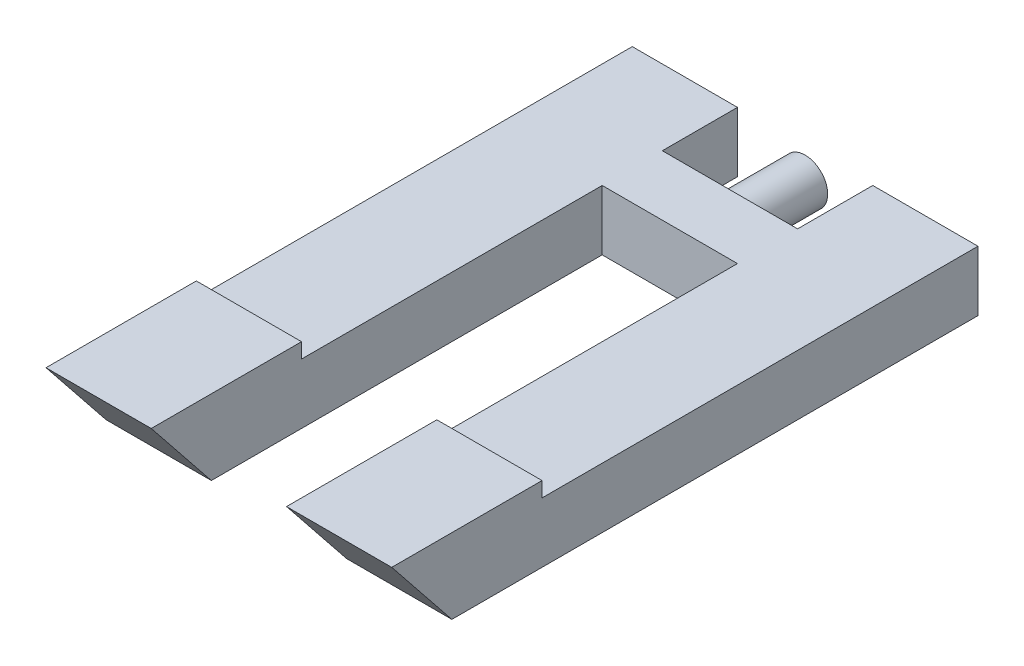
ISO-10303-21;
HEADER;
FILE_DESCRIPTION(('STEP AP214'),'2;1');
FILE_NAME('part.step','',(''),(''),'','','');
FILE_SCHEMA(('AUTOMOTIVE_DESIGN { 1 0 10303 214 1 1 1 1 }'));
ENDSEC;
DATA;
#1=APPLICATION_CONTEXT('core data for automotive mechanical design processes');
#2=APPLICATION_PROTOCOL_DEFINITION('international standard','automotive_design',2000,#1);
#3=PRODUCT_CONTEXT('',#1,'mechanical');
#4=PRODUCT('Part','Part','',(#3));
#5=PRODUCT_RELATED_PRODUCT_CATEGORY('part','',(#4));
#6=PRODUCT_DEFINITION_FORMATION('','',#4);
#7=PRODUCT_DEFINITION_CONTEXT('part definition',#1,'design');
#8=PRODUCT_DEFINITION('design','',#6,#7);
#9=PRODUCT_DEFINITION_SHAPE('','',#8);
#10=(LENGTH_UNIT() NAMED_UNIT(*) SI_UNIT(.MILLI.,.METRE.));
#11=(NAMED_UNIT(*) PLANE_ANGLE_UNIT() SI_UNIT($,.RADIAN.));
#12=(NAMED_UNIT(*) SI_UNIT($,.STERADIAN.) SOLID_ANGLE_UNIT());
#13=UNCERTAINTY_MEASURE_WITH_UNIT(LENGTH_MEASURE(1.E-05),#10,'distance_accuracy_value','');
#14=(GEOMETRIC_REPRESENTATION_CONTEXT(3) GLOBAL_UNCERTAINTY_ASSIGNED_CONTEXT((#13)) GLOBAL_UNIT_ASSIGNED_CONTEXT((#10,
#11,#12)) REPRESENTATION_CONTEXT('',''));
#15=CARTESIAN_POINT('',(0.,0.,0.));
#16=DIRECTION('',(0.,0.,1.));
#17=DIRECTION('',(1.,0.,0.));
#18=AXIS2_PLACEMENT_3D('',#15,#16,#17);
#19=CARTESIAN_POINT('',(-4.5,2.,4.));
#20=DIRECTION('',(0.,0.,-1.));
#21=DIRECTION('',(-1.,0.,0.));
#22=AXIS2_PLACEMENT_3D('',#19,#20,#21);
#23=PLANE('',#22);
#24=DIRECTION('',(1.,0.,0.));
#25=VECTOR('',#24,1.);
#26=CARTESIAN_POINT('',(-4.5,-2.,4.));
#27=LINE('',#26,#25);
#28=CARTESIAN_POINT('',(-4.5,-2.,4.));
#29=VERTEX_POINT('',#28);
#30=CARTESIAN_POINT('',(4.5,-2.,4.));
#31=VERTEX_POINT('',#30);
#32=EDGE_CURVE('E270',#29,#31,#27,.T.);
#33=ORIENTED_EDGE('',*,*,#32,.T.);
#34=DIRECTION('',(0.,-1.,0.));
#35=VECTOR('',#34,1.);
#36=CARTESIAN_POINT('',(4.5,2.,4.));
#37=LINE('',#36,#35);
#38=CARTESIAN_POINT('',(4.5,2.,4.));
#39=VERTEX_POINT('',#38);
#40=EDGE_CURVE('E209',#39,#31,#37,.T.);
#41=ORIENTED_EDGE('',*,*,#40,.F.);
#42=DIRECTION('',(1.,0.,0.));
#43=VECTOR('',#42,1.);
#44=CARTESIAN_POINT('',(-4.5,2.,4.));
#45=LINE('',#44,#43);
#46=CARTESIAN_POINT('',(-4.5,2.,4.));
#47=VERTEX_POINT('',#46);
#48=EDGE_CURVE('E271',#47,#39,#45,.T.);
#49=ORIENTED_EDGE('',*,*,#48,.F.);
#50=DIRECTION('',(0.,-1.,0.));
#51=VECTOR('',#50,1.);
#52=CARTESIAN_POINT('',(-4.5,2.,4.));
#53=LINE('',#52,#51);
#54=EDGE_CURVE('E289',#47,#29,#53,.T.);
#55=ORIENTED_EDGE('',*,*,#54,.T.);
#56=EDGE_LOOP('',(#33,#41,#49,#55));
#57=FACE_BOUND('',#56,.T.);
#58=ADVANCED_FACE('F39',(#57),#23,.F.);
#59=CARTESIAN_POINT('',(-4.5,2.,0.));
#60=DIRECTION('',(0.,0.,1.));
#61=DIRECTION('',(1.,0.,0.));
#62=AXIS2_PLACEMENT_3D('',#59,#60,#61);
#63=PLANE('',#62);
#64=CARTESIAN_POINT('',(0.,0.,0.));
#65=DIRECTION('',(0.,0.,1.));
#66=DIRECTION('',(1.,0.,0.));
#67=AXIS2_PLACEMENT_3D('',#64,#65,#66);
#68=CIRCLE('',#67,1.5);
#69=CARTESIAN_POINT('',(1.5,0.,0.));
#70=VERTEX_POINT('',#69);
#71=EDGE_CURVE('E11',#70,#70,#68,.F.);
#72=ORIENTED_EDGE('',*,*,#71,.F.);
#73=EDGE_LOOP('',(#72));
#74=FACE_BOUND('',#73,.T.);
#75=DIRECTION('',(-1.,0.,0.));
#76=VECTOR('',#75,1.);
#77=CARTESIAN_POINT('',(-4.5,-2.,0.));
#78=LINE('',#77,#76);
#79=CARTESIAN_POINT('',(4.5,-2.,0.));
#80=VERTEX_POINT('',#79);
#81=CARTESIAN_POINT('',(-4.5,-2.,0.));
#82=VERTEX_POINT('',#81);
#83=EDGE_CURVE('E292',#80,#82,#78,.T.);
#84=ORIENTED_EDGE('',*,*,#83,.T.);
#85=DIRECTION('',(0.,-1.,0.));
#86=VECTOR('',#85,1.);
#87=CARTESIAN_POINT('',(-4.5,2.,0.));
#88=LINE('',#87,#86);
#89=CARTESIAN_POINT('',(-4.5,2.,0.));
#90=VERTEX_POINT('',#89);
#91=EDGE_CURVE('E47',#90,#82,#88,.T.);
#92=ORIENTED_EDGE('',*,*,#91,.F.);
#93=DIRECTION('',(-1.,0.,0.));
#94=VECTOR('',#93,1.);
#95=CARTESIAN_POINT('',(-4.5,2.,0.));
#96=LINE('',#95,#94);
#97=CARTESIAN_POINT('',(4.5,2.,0.));
#98=VERTEX_POINT('',#97);
#99=EDGE_CURVE('E274',#98,#90,#96,.T.);
#100=ORIENTED_EDGE('',*,*,#99,.F.);
#101=DIRECTION('',(0.,-1.,0.));
#102=VECTOR('',#101,1.);
#103=CARTESIAN_POINT('',(4.5,2.,0.));
#104=LINE('',#103,#102);
#105=EDGE_CURVE('E236',#98,#80,#104,.T.);
#106=ORIENTED_EDGE('',*,*,#105,.T.);
#107=EDGE_LOOP('',(#84,#92,#100,#106));
#108=FACE_BOUND('',#107,.T.);
#109=ADVANCED_FACE('F379',(#74,#108),#63,.F.);
#110=CARTESIAN_POINT('',(-4.5,2.,0.));
#111=DIRECTION('',(-1.,0.,0.));
#112=DIRECTION('',(0.,0.,1.));
#113=AXIS2_PLACEMENT_3D('',#110,#111,#112);
#114=PLANE('',#113);
#115=DIRECTION('',(0.,0.,-1.));
#116=VECTOR('',#115,1.);
#117=CARTESIAN_POINT('',(-4.5,-2.,0.));
#118=LINE('',#117,#116);
#119=CARTESIAN_POINT('',(-4.5,-2.,-5.));
#120=VERTEX_POINT('',#119);
#121=EDGE_CURVE('E295',#82,#120,#118,.T.);
#122=ORIENTED_EDGE('',*,*,#121,.T.);
#123=DIRECTION('',(0.,-1.,0.));
#124=VECTOR('',#123,1.);
#125=CARTESIAN_POINT('',(-4.5,2.,-5.));
#126=LINE('',#125,#124);
#127=CARTESIAN_POINT('',(-4.5,2.,-5.));
#128=VERTEX_POINT('',#127);
#129=EDGE_CURVE('E317',#128,#120,#126,.T.);
#130=ORIENTED_EDGE('',*,*,#129,.F.);
#131=DIRECTION('',(0.,0.,-1.));
#132=VECTOR('',#131,1.);
#133=CARTESIAN_POINT('',(-4.5,2.,0.));
#134=LINE('',#133,#132);
#135=EDGE_CURVE('E278',#90,#128,#134,.T.);
#136=ORIENTED_EDGE('',*,*,#135,.F.);
#137=ORIENTED_EDGE('',*,*,#91,.T.);
#138=EDGE_LOOP('',(#122,#130,#136,#137));
#139=FACE_BOUND('',#138,.T.);
#140=ADVANCED_FACE('F326',(#139),#114,.F.);
#141=CARTESIAN_POINT('',(-4.5,2.,-5.));
#142=DIRECTION('',(0.,0.,1.));
#143=DIRECTION('',(1.,0.,0.));
#144=AXIS2_PLACEMENT_3D('',#141,#142,#143);
#145=PLANE('',#144);
#146=DIRECTION('',(-1.,0.,0.));
#147=VECTOR('',#146,1.);
#148=CARTESIAN_POINT('',(-4.5,-2.,-5.));
#149=LINE('',#148,#147);
#150=CARTESIAN_POINT('',(-11.5,-2.,-5.));
#151=VERTEX_POINT('',#150);
#152=EDGE_CURVE('E298',#120,#151,#149,.T.);
#153=ORIENTED_EDGE('',*,*,#152,.T.);
#154=DIRECTION('',(0.,-1.,0.));
#155=VECTOR('',#154,1.);
#156=CARTESIAN_POINT('',(-11.5,2.,-5.));
#157=LINE('',#156,#155);
#158=CARTESIAN_POINT('',(-11.5,2.,-5.));
#159=VERTEX_POINT('',#158);
#160=EDGE_CURVE('E313',#159,#151,#157,.T.);
#161=ORIENTED_EDGE('',*,*,#160,.F.);
#162=DIRECTION('',(-1.,0.,0.));
#163=VECTOR('',#162,1.);
#164=CARTESIAN_POINT('',(-4.5,2.,-5.));
#165=LINE('',#164,#163);
#166=EDGE_CURVE('E281',#128,#159,#165,.T.);
#167=ORIENTED_EDGE('',*,*,#166,.F.);
#168=ORIENTED_EDGE('',*,*,#129,.T.);
#169=EDGE_LOOP('',(#153,#161,#167,#168));
#170=FACE_BOUND('',#169,.T.);
#171=ADVANCED_FACE('F338',(#170),#145,.F.);
#172=CARTESIAN_POINT('',(-11.5,2.,-5.));
#173=DIRECTION('',(1.,0.,0.));
#174=DIRECTION('',(0.,0.,-1.));
#175=AXIS2_PLACEMENT_3D('',#172,#173,#174);
#176=PLANE('',#175);
#177=DIRECTION('',(0.,0.,1.));
#178=VECTOR('',#177,1.);
#179=CARTESIAN_POINT('',(-11.5,-2.,-5.));
#180=LINE('',#179,#178);
#181=CARTESIAN_POINT('',(-11.5,-2.,30.));
#182=VERTEX_POINT('',#181);
#183=EDGE_CURVE('E301',#151,#182,#180,.T.);
#184=ORIENTED_EDGE('',*,*,#183,.T.);
#185=DIRECTION('',(0.,0.78086880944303,0.624695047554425));
#186=VECTOR('',#185,1.);
#187=CARTESIAN_POINT('',(-11.5,3.,34.));
#188=LINE('',#187,#186);
#189=CARTESIAN_POINT('',(-11.5,3.,34.));
#190=VERTEX_POINT('',#189);
#191=EDGE_CURVE('E240',#182,#190,#188,.T.);
#192=ORIENTED_EDGE('',*,*,#191,.T.);
#193=DIRECTION('',(0.,0.,-1.));
#194=VECTOR('',#193,1.);
#195=CARTESIAN_POINT('',(-11.5,3.,24.));
#196=LINE('',#195,#194);
#197=CARTESIAN_POINT('',(-11.5,3.,24.));
#198=VERTEX_POINT('',#197);
#199=EDGE_CURVE('E251',#190,#198,#196,.T.);
#200=ORIENTED_EDGE('',*,*,#199,.T.);
#201=DIRECTION('',(0.,-1.,0.));
#202=VECTOR('',#201,1.);
#203=CARTESIAN_POINT('',(-11.5,2.,24.));
#204=LINE('',#203,#202);
#205=CARTESIAN_POINT('',(-11.5,2.,24.));
#206=VERTEX_POINT('',#205);
#207=EDGE_CURVE('E255',#198,#206,#204,.T.);
#208=ORIENTED_EDGE('',*,*,#207,.T.);
#209=DIRECTION('',(0.,0.,1.));
#210=VECTOR('',#209,1.);
#211=CARTESIAN_POINT('',(-11.5,2.,-5.));
#212=LINE('',#211,#210);
#213=EDGE_CURVE('E59',#159,#206,#212,.T.);
#214=ORIENTED_EDGE('',*,*,#213,.F.);
#215=ORIENTED_EDGE('',*,*,#160,.T.);
#216=EDGE_LOOP('',(#184,#192,#200,#208,#214,#215));
#217=FACE_BOUND('',#216,.T.);
#218=ADVANCED_FACE('F341',(#217),#176,.F.);
#219=CARTESIAN_POINT('',(-4.5,2.,30.));
#220=DIRECTION('',(-1.,0.,0.));
#221=DIRECTION('',(0.,0.,1.));
#222=AXIS2_PLACEMENT_3D('',#219,#220,#221);
#223=PLANE('',#222);
#224=DIRECTION('',(0.,-0.78086880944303,-0.624695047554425));
#225=VECTOR('',#224,1.);
#226=CARTESIAN_POINT('',(-4.5,3.,34.));
#227=LINE('',#226,#225);
#228=CARTESIAN_POINT('',(-4.5,3.,34.));
#229=VERTEX_POINT('',#228);
#230=CARTESIAN_POINT('',(-4.5,-2.,30.));
#231=VERTEX_POINT('',#230);
#232=EDGE_CURVE('E247',#229,#231,#227,.T.);
#233=ORIENTED_EDGE('',*,*,#232,.T.);
#234=DIRECTION('',(0.,0.,-1.));
#235=VECTOR('',#234,1.);
#236=CARTESIAN_POINT('',(-4.5,-2.,30.));
#237=LINE('',#236,#235);
#238=EDGE_CURVE('E275',#231,#29,#237,.T.);
#239=ORIENTED_EDGE('',*,*,#238,.T.);
#240=ORIENTED_EDGE('',*,*,#54,.F.);
#241=DIRECTION('',(0.,0.,-1.));
#242=VECTOR('',#241,1.);
#243=CARTESIAN_POINT('',(-4.5,2.,30.));
#244=LINE('',#243,#242);
#245=CARTESIAN_POINT('',(-4.5,2.,24.));
#246=VERTEX_POINT('',#245);
#247=EDGE_CURVE('E286',#246,#47,#244,.T.);
#248=ORIENTED_EDGE('',*,*,#247,.F.);
#249=DIRECTION('',(0.,1.,0.));
#250=VECTOR('',#249,1.);
#251=CARTESIAN_POINT('',(-4.5,2.,24.));
#252=LINE('',#251,#250);
#253=CARTESIAN_POINT('',(-4.5,3.,24.));
#254=VERTEX_POINT('',#253);
#255=EDGE_CURVE('E244',#246,#254,#252,.T.);
#256=ORIENTED_EDGE('',*,*,#255,.T.);
#257=DIRECTION('',(0.,0.,1.));
#258=VECTOR('',#257,1.);
#259=CARTESIAN_POINT('',(-4.5,3.,24.));
#260=LINE('',#259,#258);
#261=EDGE_CURVE('E241',#254,#229,#260,.T.);
#262=ORIENTED_EDGE('',*,*,#261,.T.);
#263=EDGE_LOOP('',(#233,#239,#240,#248,#256,#262));
#264=FACE_BOUND('',#263,.T.);
#265=ADVANCED_FACE('F350',(#264),#223,.F.);
#266=CARTESIAN_POINT('',(0.,2.,0.));
#267=DIRECTION('',(0.,-1.,0.));
#268=DIRECTION('',(0.,0.,-1.));
#269=AXIS2_PLACEMENT_3D('',#266,#267,#268);
#270=PLANE('',#269);
#271=ORIENTED_EDGE('',*,*,#213,.T.);
#272=DIRECTION('',(-1.,0.,0.));
#273=VECTOR('',#272,1.);
#274=CARTESIAN_POINT('',(6.68033988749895,2.,24.));
#275=LINE('',#274,#273);
#276=EDGE_CURVE('E54',#246,#206,#275,.T.);
#277=ORIENTED_EDGE('',*,*,#276,.F.);
#278=ORIENTED_EDGE('',*,*,#247,.T.);
#279=ORIENTED_EDGE('',*,*,#48,.T.);
#280=DIRECTION('',(0.,0.,-1.));
#281=VECTOR('',#280,1.);
#282=CARTESIAN_POINT('',(4.50000000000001,2.,30.));
#283=LINE('',#282,#281);
#284=CARTESIAN_POINT('',(4.5,2.,24.));
#285=VERTEX_POINT('',#284);
#286=EDGE_CURVE('E205',#285,#39,#283,.T.);
#287=ORIENTED_EDGE('',*,*,#286,.F.);
#288=DIRECTION('',(1.,0.,0.));
#289=VECTOR('',#288,1.);
#290=CARTESIAN_POINT('',(-6.68033988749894,2.,24.));
#291=LINE('',#290,#289);
#292=CARTESIAN_POINT('',(11.5,2.,24.));
#293=VERTEX_POINT('',#292);
#294=EDGE_CURVE('E183',#285,#293,#291,.T.);
#295=ORIENTED_EDGE('',*,*,#294,.T.);
#296=DIRECTION('',(0.,0.,1.));
#297=VECTOR('',#296,1.);
#298=CARTESIAN_POINT('',(11.5,2.,-5.));
#299=LINE('',#298,#297);
#300=CARTESIAN_POINT('',(11.5,2.,-5.));
#301=VERTEX_POINT('',#300);
#302=EDGE_CURVE('E202',#301,#293,#299,.T.);
#303=ORIENTED_EDGE('',*,*,#302,.F.);
#304=DIRECTION('',(1.,0.,0.));
#305=VECTOR('',#304,1.);
#306=CARTESIAN_POINT('',(4.5,2.,-5.));
#307=LINE('',#306,#305);
#308=CARTESIAN_POINT('',(4.5,2.,-5.));
#309=VERTEX_POINT('',#308);
#310=EDGE_CURVE('E197',#309,#301,#307,.T.);
#311=ORIENTED_EDGE('',*,*,#310,.F.);
#312=DIRECTION('',(0.,0.,-1.));
#313=VECTOR('',#312,1.);
#314=CARTESIAN_POINT('',(4.5,2.,0.));
#315=LINE('',#314,#313);
#316=EDGE_CURVE('E193',#98,#309,#315,.T.);
#317=ORIENTED_EDGE('',*,*,#316,.F.);
#318=ORIENTED_EDGE('',*,*,#99,.T.);
#319=ORIENTED_EDGE('',*,*,#135,.T.);
#320=ORIENTED_EDGE('',*,*,#166,.T.);
#321=EDGE_LOOP('',(#271,#277,#278,#279,#287,#295,#303,#311,#317,#318,#319,#320));
#322=FACE_BOUND('',#321,.T.);
#323=ADVANCED_FACE('F368',(#322),#270,.F.);
#324=CARTESIAN_POINT('',(0.,-2.,0.));
#325=DIRECTION('',(0.,-1.,0.));
#326=DIRECTION('',(0.,0.,-1.));
#327=AXIS2_PLACEMENT_3D('',#324,#325,#326);
#328=PLANE('',#327);
#329=ORIENTED_EDGE('',*,*,#32,.F.);
#330=ORIENTED_EDGE('',*,*,#238,.F.);
#331=DIRECTION('',(1.,0.,0.));
#332=VECTOR('',#331,1.);
#333=CARTESIAN_POINT('',(-11.5,-2.,30.));
#334=LINE('',#333,#332);
#335=EDGE_CURVE('E304',#182,#231,#334,.T.);
#336=ORIENTED_EDGE('',*,*,#335,.F.);
#337=ORIENTED_EDGE('',*,*,#183,.F.);
#338=ORIENTED_EDGE('',*,*,#152,.F.);
#339=ORIENTED_EDGE('',*,*,#121,.F.);
#340=ORIENTED_EDGE('',*,*,#83,.F.);
#341=DIRECTION('',(0.,0.,-1.));
#342=VECTOR('',#341,1.);
#343=CARTESIAN_POINT('',(4.5,-2.,0.));
#344=LINE('',#343,#342);
#345=CARTESIAN_POINT('',(4.5,-2.,-5.));
#346=VERTEX_POINT('',#345);
#347=EDGE_CURVE('E191',#80,#346,#344,.T.);
#348=ORIENTED_EDGE('',*,*,#347,.T.);
#349=DIRECTION('',(1.,0.,0.));
#350=VECTOR('',#349,1.);
#351=CARTESIAN_POINT('',(4.5,-2.,-5.));
#352=LINE('',#351,#350);
#353=CARTESIAN_POINT('',(11.5,-2.,-5.));
#354=VERTEX_POINT('',#353);
#355=EDGE_CURVE('E213',#346,#354,#352,.T.);
#356=ORIENTED_EDGE('',*,*,#355,.T.);
#357=DIRECTION('',(0.,0.,1.));
#358=VECTOR('',#357,1.);
#359=CARTESIAN_POINT('',(11.5,-2.,-5.));
#360=LINE('',#359,#358);
#361=CARTESIAN_POINT('',(11.5,-2.,30.));
#362=VERTEX_POINT('',#361);
#363=EDGE_CURVE('E217',#354,#362,#360,.T.);
#364=ORIENTED_EDGE('',*,*,#363,.T.);
#365=DIRECTION('',(-1.,0.,0.));
#366=VECTOR('',#365,1.);
#367=CARTESIAN_POINT('',(11.5,-2.,30.));
#368=LINE('',#367,#366);
#369=CARTESIAN_POINT('',(4.50000000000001,-2.,30.));
#370=VERTEX_POINT('',#369);
#371=EDGE_CURVE('E168',#362,#370,#368,.T.);
#372=ORIENTED_EDGE('',*,*,#371,.T.);
#373=DIRECTION('',(0.,0.,-1.));
#374=VECTOR('',#373,1.);
#375=CARTESIAN_POINT('',(4.50000000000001,-2.,30.));
#376=LINE('',#375,#374);
#377=EDGE_CURVE('E198',#370,#31,#376,.T.);
#378=ORIENTED_EDGE('',*,*,#377,.T.);
#379=EDGE_LOOP('',(#329,#330,#336,#337,#338,#339,#340,#348,#356,#364,#372,#378));
#380=FACE_BOUND('',#379,.T.);
#381=ADVANCED_FACE('F332',(#380),#328,.T.);
#382=CARTESIAN_POINT('',(6.68033988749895,2.,24.));
#383=DIRECTION('',(0.,0.,-1.));
#384=DIRECTION('',(-1.,0.,0.));
#385=AXIS2_PLACEMENT_3D('',#382,#383,#384);
#386=PLANE('',#385);
#387=ORIENTED_EDGE('',*,*,#255,.F.);
#388=ORIENTED_EDGE('',*,*,#276,.T.);
#389=ORIENTED_EDGE('',*,*,#207,.F.);
#390=DIRECTION('',(-1.,0.,0.));
#391=VECTOR('',#390,1.);
#392=CARTESIAN_POINT('',(6.68033988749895,3.,24.));
#393=LINE('',#392,#391);
#394=EDGE_CURVE('E262',#254,#198,#393,.T.);
#395=ORIENTED_EDGE('',*,*,#394,.F.);
#396=EDGE_LOOP('',(#387,#388,#389,#395));
#397=FACE_BOUND('',#396,.T.);
#398=ADVANCED_FACE('F347',(#397),#386,.T.);
#399=CARTESIAN_POINT('',(6.68033988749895,3.,24.));
#400=DIRECTION('',(0.,1.,0.));
#401=DIRECTION('',(0.,0.,1.));
#402=AXIS2_PLACEMENT_3D('',#399,#400,#401);
#403=PLANE('',#402);
#404=ORIENTED_EDGE('',*,*,#261,.F.);
#405=ORIENTED_EDGE('',*,*,#394,.T.);
#406=ORIENTED_EDGE('',*,*,#199,.F.);
#407=DIRECTION('',(-1.,0.,0.));
#408=VECTOR('',#407,1.);
#409=CARTESIAN_POINT('',(6.68033988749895,3.,34.));
#410=LINE('',#409,#408);
#411=EDGE_CURVE('E259',#229,#190,#410,.T.);
#412=ORIENTED_EDGE('',*,*,#411,.F.);
#413=EDGE_LOOP('',(#404,#405,#406,#412));
#414=FACE_BOUND('',#413,.T.);
#415=ADVANCED_FACE('F354',(#414),#403,.T.);
#416=CARTESIAN_POINT('',(6.68033988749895,3.,34.));
#417=DIRECTION('',(0.,-0.624695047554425,0.78086880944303));
#418=DIRECTION('',(0.,-0.78086880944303,-0.624695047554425));
#419=AXIS2_PLACEMENT_3D('',#416,#417,#418);
#420=PLANE('',#419);
#421=ORIENTED_EDGE('',*,*,#232,.F.);
#422=ORIENTED_EDGE('',*,*,#411,.T.);
#423=ORIENTED_EDGE('',*,*,#191,.F.);
#424=ORIENTED_EDGE('',*,*,#335,.T.);
#425=EDGE_LOOP('',(#421,#422,#423,#424));
#426=FACE_BOUND('',#425,.T.);
#427=ADVANCED_FACE('F358',(#426),#420,.T.);
#428=CARTESIAN_POINT('',(4.5,2.,0.));
#429=DIRECTION('',(1.,0.,0.));
#430=DIRECTION('',(0.,0.,1.));
#431=AXIS2_PLACEMENT_3D('',#428,#429,#430);
#432=PLANE('',#431);
#433=ORIENTED_EDGE('',*,*,#347,.F.);
#434=ORIENTED_EDGE('',*,*,#105,.F.);
#435=ORIENTED_EDGE('',*,*,#316,.T.);
#436=DIRECTION('',(0.,-1.,0.));
#437=VECTOR('',#436,1.);
#438=CARTESIAN_POINT('',(4.5,2.,-5.));
#439=LINE('',#438,#437);
#440=EDGE_CURVE('E232',#309,#346,#439,.T.);
#441=ORIENTED_EDGE('',*,*,#440,.T.);
#442=EDGE_LOOP('',(#433,#434,#435,#441));
#443=FACE_BOUND('',#442,.T.);
#444=ADVANCED_FACE('F378',(#443),#432,.F.);
#445=CARTESIAN_POINT('',(4.5,2.,-5.));
#446=DIRECTION('',(0.,0.,1.));
#447=DIRECTION('',(-1.,0.,0.));
#448=AXIS2_PLACEMENT_3D('',#445,#446,#447);
#449=PLANE('',#448);
#450=ORIENTED_EDGE('',*,*,#355,.F.);
#451=ORIENTED_EDGE('',*,*,#440,.F.);
#452=ORIENTED_EDGE('',*,*,#310,.T.);
#453=DIRECTION('',(0.,-1.,0.));
#454=VECTOR('',#453,1.);
#455=CARTESIAN_POINT('',(11.5,2.,-5.));
#456=LINE('',#455,#454);
#457=EDGE_CURVE('E228',#301,#354,#456,.T.);
#458=ORIENTED_EDGE('',*,*,#457,.T.);
#459=EDGE_LOOP('',(#450,#451,#452,#458));
#460=FACE_BOUND('',#459,.T.);
#461=ADVANCED_FACE('F374',(#460),#449,.F.);
#462=CARTESIAN_POINT('',(11.5,2.,-5.));
#463=DIRECTION('',(-1.,0.,0.));
#464=DIRECTION('',(0.,0.,-1.));
#465=AXIS2_PLACEMENT_3D('',#462,#463,#464);
#466=PLANE('',#465);
#467=ORIENTED_EDGE('',*,*,#363,.F.);
#468=ORIENTED_EDGE('',*,*,#457,.F.);
#469=ORIENTED_EDGE('',*,*,#302,.T.);
#470=DIRECTION('',(0.,-1.,0.));
#471=VECTOR('',#470,1.);
#472=CARTESIAN_POINT('',(11.5,2.,24.));
#473=LINE('',#472,#471);
#474=CARTESIAN_POINT('',(11.5,3.,24.));
#475=VERTEX_POINT('',#474);
#476=EDGE_CURVE('E163',#475,#293,#473,.T.);
#477=ORIENTED_EDGE('',*,*,#476,.F.);
#478=DIRECTION('',(0.,0.,-1.));
#479=VECTOR('',#478,1.);
#480=CARTESIAN_POINT('',(11.5,3.,24.));
#481=LINE('',#480,#479);
#482=CARTESIAN_POINT('',(11.5,3.,34.));
#483=VERTEX_POINT('',#482);
#484=EDGE_CURVE('E154',#483,#475,#481,.T.);
#485=ORIENTED_EDGE('',*,*,#484,.F.);
#486=DIRECTION('',(0.,0.78086880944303,0.624695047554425));
#487=VECTOR('',#486,1.);
#488=CARTESIAN_POINT('',(11.5,3.,34.));
#489=LINE('',#488,#487);
#490=EDGE_CURVE('E166',#362,#483,#489,.T.);
#491=ORIENTED_EDGE('',*,*,#490,.F.);
#492=EDGE_LOOP('',(#467,#468,#469,#477,#485,#491));
#493=FACE_BOUND('',#492,.T.);
#494=ADVANCED_FACE('F174',(#493),#466,.F.);
#495=CARTESIAN_POINT('',(4.50000000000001,2.,30.));
#496=DIRECTION('',(1.,0.,0.));
#497=DIRECTION('',(0.,0.,1.));
#498=AXIS2_PLACEMENT_3D('',#495,#496,#497);
#499=PLANE('',#498);
#500=DIRECTION('',(0.,-0.78086880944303,-0.624695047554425));
#501=VECTOR('',#500,1.);
#502=CARTESIAN_POINT('',(4.50000000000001,3.,34.));
#503=LINE('',#502,#501);
#504=CARTESIAN_POINT('',(4.50000000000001,3.,34.));
#505=VERTEX_POINT('',#504);
#506=EDGE_CURVE('E188',#505,#370,#503,.T.);
#507=ORIENTED_EDGE('',*,*,#506,.F.);
#508=DIRECTION('',(0.,0.,1.));
#509=VECTOR('',#508,1.);
#510=CARTESIAN_POINT('',(4.5,3.,24.));
#511=LINE('',#510,#509);
#512=CARTESIAN_POINT('',(4.5,3.,24.));
#513=VERTEX_POINT('',#512);
#514=EDGE_CURVE('E157',#513,#505,#511,.T.);
#515=ORIENTED_EDGE('',*,*,#514,.F.);
#516=DIRECTION('',(0.,1.,0.));
#517=VECTOR('',#516,1.);
#518=CARTESIAN_POINT('',(4.5,2.,24.));
#519=LINE('',#518,#517);
#520=EDGE_CURVE('E192',#285,#513,#519,.T.);
#521=ORIENTED_EDGE('',*,*,#520,.F.);
#522=ORIENTED_EDGE('',*,*,#286,.T.);
#523=ORIENTED_EDGE('',*,*,#40,.T.);
#524=ORIENTED_EDGE('',*,*,#377,.F.);
#525=EDGE_LOOP('',(#507,#515,#521,#522,#523,#524));
#526=FACE_BOUND('',#525,.T.);
#527=ADVANCED_FACE('F364',(#526),#499,.F.);
#528=CARTESIAN_POINT('',(-6.68033988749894,2.,24.));
#529=DIRECTION('',(0.,0.,-1.));
#530=DIRECTION('',(1.,0.,0.));
#531=AXIS2_PLACEMENT_3D('',#528,#529,#530);
#532=PLANE('',#531);
#533=ORIENTED_EDGE('',*,*,#520,.T.);
#534=DIRECTION('',(1.,0.,0.));
#535=VECTOR('',#534,1.);
#536=CARTESIAN_POINT('',(-6.68033988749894,3.,24.));
#537=LINE('',#536,#535);
#538=EDGE_CURVE('E162',#513,#475,#537,.T.);
#539=ORIENTED_EDGE('',*,*,#538,.T.);
#540=ORIENTED_EDGE('',*,*,#476,.T.);
#541=ORIENTED_EDGE('',*,*,#294,.F.);
#542=EDGE_LOOP('',(#533,#539,#540,#541));
#543=FACE_BOUND('',#542,.T.);
#544=ADVANCED_FACE('F371',(#543),#532,.T.);
#545=CARTESIAN_POINT('',(-6.68033988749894,3.,24.));
#546=DIRECTION('',(0.,1.,0.));
#547=DIRECTION('',(0.,0.,1.));
#548=AXIS2_PLACEMENT_3D('',#545,#546,#547);
#549=PLANE('',#548);
#550=ORIENTED_EDGE('',*,*,#514,.T.);
#551=DIRECTION('',(1.,0.,0.));
#552=VECTOR('',#551,1.);
#553=CARTESIAN_POINT('',(-6.68033988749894,3.,34.));
#554=LINE('',#553,#552);
#555=EDGE_CURVE('E150',#505,#483,#554,.T.);
#556=ORIENTED_EDGE('',*,*,#555,.T.);
#557=ORIENTED_EDGE('',*,*,#484,.T.);
#558=ORIENTED_EDGE('',*,*,#538,.F.);
#559=EDGE_LOOP('',(#550,#556,#557,#558));
#560=FACE_BOUND('',#559,.T.);
#561=ADVANCED_FACE('F152',(#560),#549,.T.);
#562=CARTESIAN_POINT('',(-6.68033988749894,3.,34.));
#563=DIRECTION('',(0.,-0.624695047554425,0.78086880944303));
#564=DIRECTION('',(0.,-0.78086880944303,-0.624695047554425));
#565=AXIS2_PLACEMENT_3D('',#562,#563,#564);
#566=PLANE('',#565);
#567=ORIENTED_EDGE('',*,*,#506,.T.);
#568=ORIENTED_EDGE('',*,*,#371,.F.);
#569=ORIENTED_EDGE('',*,*,#490,.T.);
#570=ORIENTED_EDGE('',*,*,#555,.F.);
#571=EDGE_LOOP('',(#567,#568,#569,#570));
#572=FACE_BOUND('',#571,.T.);
#573=ADVANCED_FACE('F167',(#572),#566,.T.);
#574=CARTESIAN_POINT('',(0.,0.,-5.));
#575=DIRECTION('',(0.,0.,1.));
#576=DIRECTION('',(1.,0.,0.));
#577=AXIS2_PLACEMENT_3D('',#574,#575,#576);
#578=CYLINDRICAL_SURFACE('',#577,1.5);
#579=CARTESIAN_POINT('',(0.,0.,-5.));
#580=DIRECTION('',(0.,0.,-1.));
#581=DIRECTION('',(-1.,0.,0.));
#582=AXIS2_PLACEMENT_3D('',#579,#580,#581);
#583=CIRCLE('',#582,1.5);
#584=CARTESIAN_POINT('',(-1.5,0.,-5.));
#585=VERTEX_POINT('',#584);
#586=EDGE_CURVE('E172',#585,#585,#583,.T.);
#587=ORIENTED_EDGE('',*,*,#586,.F.);
#588=EDGE_LOOP('',(#587));
#589=FACE_BOUND('',#588,.T.);
#590=ORIENTED_EDGE('',*,*,#71,.T.);
#591=EDGE_LOOP('',(#590));
#592=FACE_BOUND('',#591,.T.);
#593=ADVANCED_FACE('F415',(#589,#592),#578,.T.);
#594=CARTESIAN_POINT('',(0.,0.,-5.));
#595=DIRECTION('',(0.,0.,-1.));
#596=DIRECTION('',(-1.,0.,0.));
#597=AXIS2_PLACEMENT_3D('',#594,#595,#596);
#598=PLANE('',#597);
#599=ORIENTED_EDGE('',*,*,#586,.T.);
#600=EDGE_LOOP('',(#599));
#601=FACE_BOUND('',#600,.T.);
#602=ADVANCED_FACE('F422',(#601),#598,.T.);
#603=CLOSED_SHELL('',(#58,#109,#140,#171,#218,#265,#323,#381,#398,#415,#427,#444,#461,#494,#527,
#544,#561,#573,#593,#602));
#604=MANIFOLD_SOLID_BREP('B2',#603);
#605=ADVANCED_BREP_SHAPE_REPRESENTATION('',(#18,#604),#14);
#606=SHAPE_DEFINITION_REPRESENTATION(#9,#605);
ENDSEC;
END-ISO-10303-21;
